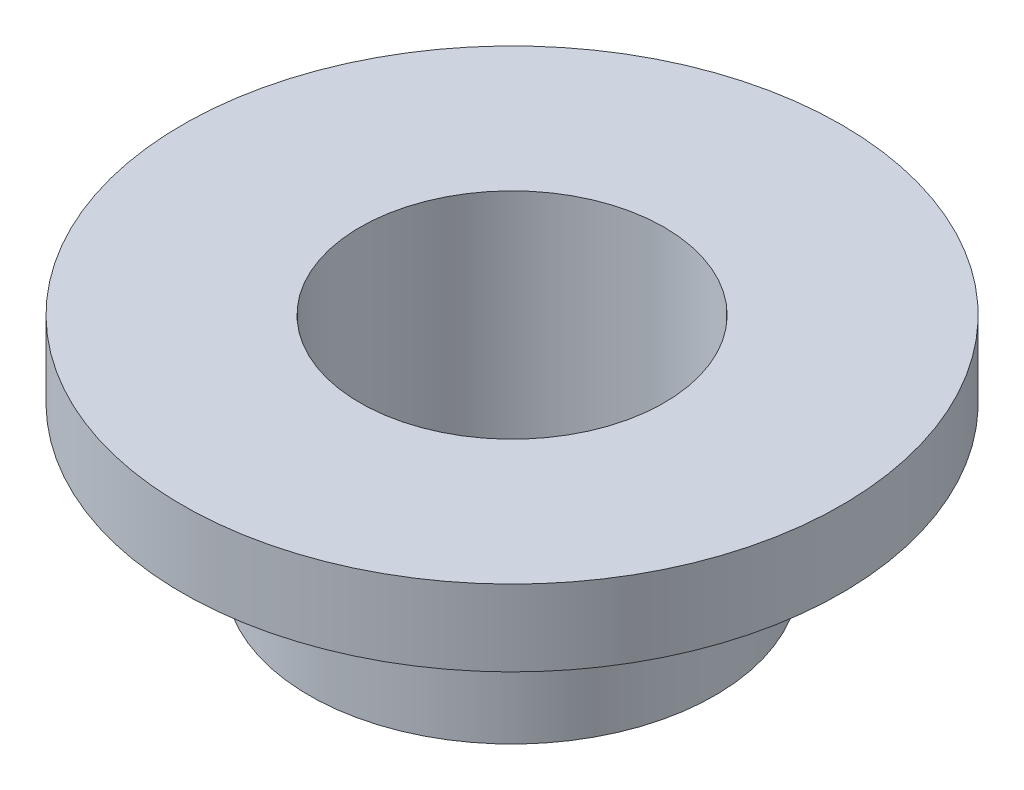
from build123d import *


with BuildPart() as part:
    # Esquisse1 → Base-R_volution (revolve)
    with BuildSketch(Plane.XY, mode=Mode.PRIVATE) as base_r_volution_sk:
        Polygon((6, 9), (6, 0), (8, 0), (8, 6), (13, 6), (13, 9), align=None)
    revolve(base_r_volution_sk.sketch.rotate(Axis((0, 0, 0), (0, 1, 0)), 90), axis=Axis((0, 0, 0), (0, 1, 0)))


solid = part.part
